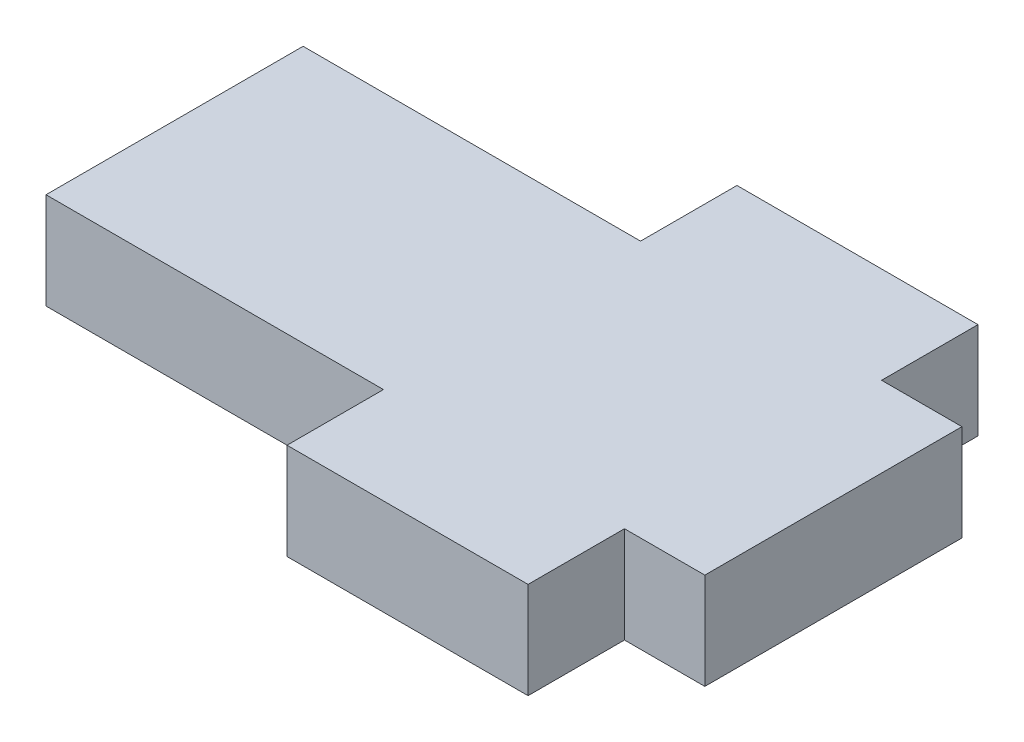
ISO-10303-21;
HEADER;
FILE_DESCRIPTION(('STEP AP214'),'2;1');
FILE_NAME('part.step','',(''),(''),'','','');
FILE_SCHEMA(('AUTOMOTIVE_DESIGN { 1 0 10303 214 1 1 1 1 }'));
ENDSEC;
DATA;
#1=APPLICATION_CONTEXT('core data for automotive mechanical design processes');
#2=APPLICATION_PROTOCOL_DEFINITION('international standard','automotive_design',2000,#1);
#3=PRODUCT_CONTEXT('',#1,'mechanical');
#4=PRODUCT('Part','Part','',(#3));
#5=PRODUCT_RELATED_PRODUCT_CATEGORY('part','',(#4));
#6=PRODUCT_DEFINITION_FORMATION('','',#4);
#7=PRODUCT_DEFINITION_CONTEXT('part definition',#1,'design');
#8=PRODUCT_DEFINITION('design','',#6,#7);
#9=PRODUCT_DEFINITION_SHAPE('','',#8);
#10=(LENGTH_UNIT() NAMED_UNIT(*) SI_UNIT(.MILLI.,.METRE.));
#11=(NAMED_UNIT(*) PLANE_ANGLE_UNIT() SI_UNIT($,.RADIAN.));
#12=(NAMED_UNIT(*) SI_UNIT($,.STERADIAN.) SOLID_ANGLE_UNIT());
#13=UNCERTAINTY_MEASURE_WITH_UNIT(LENGTH_MEASURE(1.E-05),#10,'distance_accuracy_value','');
#14=(GEOMETRIC_REPRESENTATION_CONTEXT(3) GLOBAL_UNCERTAINTY_ASSIGNED_CONTEXT((#13)) GLOBAL_UNIT_ASSIGNED_CONTEXT((#10,
#11,#12)) REPRESENTATION_CONTEXT('',''));
#15=CARTESIAN_POINT('',(0.,0.,0.));
#16=DIRECTION('',(0.,0.,1.));
#17=DIRECTION('',(1.,0.,0.));
#18=AXIS2_PLACEMENT_3D('',#15,#16,#17);
#19=CARTESIAN_POINT('',(7.5,6.,7.99999999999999));
#20=DIRECTION('',(0.,0.,-1.));
#21=DIRECTION('',(-1.,0.,0.));
#22=AXIS2_PLACEMENT_3D('',#19,#20,#21);
#23=PLANE('',#22);
#24=DIRECTION('',(1.,0.,0.));
#25=VECTOR('',#24,1.);
#26=CARTESIAN_POINT('',(7.5,0.,7.99999999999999));
#27=LINE('',#26,#25);
#28=CARTESIAN_POINT('',(7.5,0.,7.99999999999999));
#29=VERTEX_POINT('',#28);
#30=CARTESIAN_POINT('',(12.5,0.,8.));
#31=VERTEX_POINT('',#30);
#32=EDGE_CURVE('E170',#29,#31,#27,.T.);
#33=ORIENTED_EDGE('',*,*,#32,.T.);
#34=DIRECTION('',(0.,-1.,0.));
#35=VECTOR('',#34,1.);
#36=CARTESIAN_POINT('',(12.5,6.,8.));
#37=LINE('',#36,#35);
#38=CARTESIAN_POINT('',(12.5,6.,8.));
#39=VERTEX_POINT('',#38);
#40=EDGE_CURVE('E11',#39,#31,#37,.T.);
#41=ORIENTED_EDGE('',*,*,#40,.F.);
#42=DIRECTION('',(1.,0.,0.));
#43=VECTOR('',#42,1.);
#44=CARTESIAN_POINT('',(7.5,6.,7.99999999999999));
#45=LINE('',#44,#43);
#46=CARTESIAN_POINT('',(7.5,6.,7.99999999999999));
#47=VERTEX_POINT('',#46);
#48=EDGE_CURVE('E206',#47,#39,#45,.T.);
#49=ORIENTED_EDGE('',*,*,#48,.F.);
#50=DIRECTION('',(0.,-1.,0.));
#51=VECTOR('',#50,1.);
#52=CARTESIAN_POINT('',(7.5,6.,7.99999999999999));
#53=LINE('',#52,#51);
#54=EDGE_CURVE('E166',#47,#29,#53,.T.);
#55=ORIENTED_EDGE('',*,*,#54,.T.);
#56=EDGE_LOOP('',(#33,#41,#49,#55));
#57=FACE_BOUND('',#56,.T.);
#58=ADVANCED_FACE('F45',(#57),#23,.F.);
#59=CARTESIAN_POINT('',(12.5,6.,-8.));
#60=DIRECTION('',(-1.,0.,0.));
#61=DIRECTION('',(0.,0.,1.));
#62=AXIS2_PLACEMENT_3D('',#59,#60,#61);
#63=PLANE('',#62);
#64=DIRECTION('',(0.,0.,-1.));
#65=VECTOR('',#64,1.);
#66=CARTESIAN_POINT('',(12.5,0.,-8.));
#67=LINE('',#66,#65);
#68=CARTESIAN_POINT('',(12.5,0.,-8.));
#69=VERTEX_POINT('',#68);
#70=EDGE_CURVE('E174',#31,#69,#67,.T.);
#71=ORIENTED_EDGE('',*,*,#70,.T.);
#72=DIRECTION('',(0.,-1.,0.));
#73=VECTOR('',#72,1.);
#74=CARTESIAN_POINT('',(12.5,6.,-8.));
#75=LINE('',#74,#73);
#76=CARTESIAN_POINT('',(12.5,6.,-8.));
#77=VERTEX_POINT('',#76);
#78=EDGE_CURVE('E54',#77,#69,#75,.T.);
#79=ORIENTED_EDGE('',*,*,#78,.F.);
#80=DIRECTION('',(0.,0.,-1.));
#81=VECTOR('',#80,1.);
#82=CARTESIAN_POINT('',(12.5,6.,-8.));
#83=LINE('',#82,#81);
#84=EDGE_CURVE('E117',#39,#77,#83,.T.);
#85=ORIENTED_EDGE('',*,*,#84,.F.);
#86=ORIENTED_EDGE('',*,*,#40,.T.);
#87=EDGE_LOOP('',(#71,#79,#85,#86));
#88=FACE_BOUND('',#87,.T.);
#89=ADVANCED_FACE('F299',(#88),#63,.F.);
#90=CARTESIAN_POINT('',(7.5,6.,-8.));
#91=DIRECTION('',(0.,0.,1.));
#92=DIRECTION('',(1.,0.,0.));
#93=AXIS2_PLACEMENT_3D('',#90,#91,#92);
#94=PLANE('',#93);
#95=DIRECTION('',(-1.,0.,0.));
#96=VECTOR('',#95,1.);
#97=CARTESIAN_POINT('',(7.5,0.,-8.));
#98=LINE('',#97,#96);
#99=CARTESIAN_POINT('',(7.5,0.,-8.));
#100=VERTEX_POINT('',#99);
#101=EDGE_CURVE('E177',#69,#100,#98,.T.);
#102=ORIENTED_EDGE('',*,*,#101,.T.);
#103=DIRECTION('',(0.,-1.,0.));
#104=VECTOR('',#103,1.);
#105=CARTESIAN_POINT('',(7.5,6.,-8.));
#106=LINE('',#105,#104);
#107=CARTESIAN_POINT('',(7.5,6.,-8.));
#108=VERTEX_POINT('',#107);
#109=EDGE_CURVE('E233',#108,#100,#106,.T.);
#110=ORIENTED_EDGE('',*,*,#109,.F.);
#111=DIRECTION('',(-1.,0.,0.));
#112=VECTOR('',#111,1.);
#113=CARTESIAN_POINT('',(7.5,6.,-8.));
#114=LINE('',#113,#112);
#115=EDGE_CURVE('E243',#77,#108,#114,.T.);
#116=ORIENTED_EDGE('',*,*,#115,.F.);
#117=ORIENTED_EDGE('',*,*,#78,.T.);
#118=EDGE_LOOP('',(#102,#110,#116,#117));
#119=FACE_BOUND('',#118,.T.);
#120=ADVANCED_FACE('F241',(#119),#94,.F.);
#121=CARTESIAN_POINT('',(7.5,6.,-14.));
#122=DIRECTION('',(-1.,0.,0.));
#123=DIRECTION('',(0.,0.,1.));
#124=AXIS2_PLACEMENT_3D('',#121,#122,#123);
#125=PLANE('',#124);
#126=DIRECTION('',(0.,0.,-1.));
#127=VECTOR('',#126,1.);
#128=CARTESIAN_POINT('',(7.5,0.,-14.));
#129=LINE('',#128,#127);
#130=CARTESIAN_POINT('',(7.5,0.,-14.));
#131=VERTEX_POINT('',#130);
#132=EDGE_CURVE('E180',#100,#131,#129,.T.);
#133=ORIENTED_EDGE('',*,*,#132,.T.);
#134=DIRECTION('',(0.,-1.,0.));
#135=VECTOR('',#134,1.);
#136=CARTESIAN_POINT('',(7.5,6.,-14.));
#137=LINE('',#136,#135);
#138=CARTESIAN_POINT('',(7.5,6.,-14.));
#139=VERTEX_POINT('',#138);
#140=EDGE_CURVE('E229',#139,#131,#137,.T.);
#141=ORIENTED_EDGE('',*,*,#140,.F.);
#142=DIRECTION('',(0.,0.,-1.));
#143=VECTOR('',#142,1.);
#144=CARTESIAN_POINT('',(7.5,6.,-14.));
#145=LINE('',#144,#143);
#146=EDGE_CURVE('E262',#108,#139,#145,.T.);
#147=ORIENTED_EDGE('',*,*,#146,.F.);
#148=ORIENTED_EDGE('',*,*,#109,.T.);
#149=EDGE_LOOP('',(#133,#141,#147,#148));
#150=FACE_BOUND('',#149,.T.);
#151=ADVANCED_FACE('F252',(#150),#125,.F.);
#152=CARTESIAN_POINT('',(-7.5,6.,-14.));
#153=DIRECTION('',(0.,0.,1.));
#154=DIRECTION('',(1.,0.,0.));
#155=AXIS2_PLACEMENT_3D('',#152,#153,#154);
#156=PLANE('',#155);
#157=DIRECTION('',(-1.,0.,0.));
#158=VECTOR('',#157,1.);
#159=CARTESIAN_POINT('',(-7.5,0.,-14.));
#160=LINE('',#159,#158);
#161=CARTESIAN_POINT('',(-7.5,0.,-14.));
#162=VERTEX_POINT('',#161);
#163=EDGE_CURVE('E183',#131,#162,#160,.T.);
#164=ORIENTED_EDGE('',*,*,#163,.T.);
#165=DIRECTION('',(0.,-1.,0.));
#166=VECTOR('',#165,1.);
#167=CARTESIAN_POINT('',(-7.5,6.,-14.));
#168=LINE('',#167,#166);
#169=CARTESIAN_POINT('',(-7.5,6.,-14.));
#170=VERTEX_POINT('',#169);
#171=EDGE_CURVE('E225',#170,#162,#168,.T.);
#172=ORIENTED_EDGE('',*,*,#171,.F.);
#173=DIRECTION('',(-1.,0.,0.));
#174=VECTOR('',#173,1.);
#175=CARTESIAN_POINT('',(-7.5,6.,-14.));
#176=LINE('',#175,#174);
#177=EDGE_CURVE('E258',#139,#170,#176,.T.);
#178=ORIENTED_EDGE('',*,*,#177,.F.);
#179=ORIENTED_EDGE('',*,*,#140,.T.);
#180=EDGE_LOOP('',(#164,#172,#178,#179));
#181=FACE_BOUND('',#180,.T.);
#182=ADVANCED_FACE('F256',(#181),#156,.F.);
#183=CARTESIAN_POINT('',(-7.5,6.,-8.));
#184=DIRECTION('',(1.,0.,0.));
#185=DIRECTION('',(0.,0.,-1.));
#186=AXIS2_PLACEMENT_3D('',#183,#184,#185);
#187=PLANE('',#186);
#188=DIRECTION('',(0.,0.,1.));
#189=VECTOR('',#188,1.);
#190=CARTESIAN_POINT('',(-7.5,0.,-8.));
#191=LINE('',#190,#189);
#192=CARTESIAN_POINT('',(-7.5,0.,-8.));
#193=VERTEX_POINT('',#192);
#194=EDGE_CURVE('E186',#162,#193,#191,.T.);
#195=ORIENTED_EDGE('',*,*,#194,.T.);
#196=DIRECTION('',(0.,-1.,0.));
#197=VECTOR('',#196,1.);
#198=CARTESIAN_POINT('',(-7.5,6.,-8.));
#199=LINE('',#198,#197);
#200=CARTESIAN_POINT('',(-7.5,6.,-8.));
#201=VERTEX_POINT('',#200);
#202=EDGE_CURVE('E221',#201,#193,#199,.T.);
#203=ORIENTED_EDGE('',*,*,#202,.F.);
#204=DIRECTION('',(0.,0.,1.));
#205=VECTOR('',#204,1.);
#206=CARTESIAN_POINT('',(-7.5,6.,-8.));
#207=LINE('',#206,#205);
#208=EDGE_CURVE('E261',#170,#201,#207,.T.);
#209=ORIENTED_EDGE('',*,*,#208,.F.);
#210=ORIENTED_EDGE('',*,*,#171,.T.);
#211=EDGE_LOOP('',(#195,#203,#209,#210));
#212=FACE_BOUND('',#211,.T.);
#213=ADVANCED_FACE('F312',(#212),#187,.F.);
#214=CARTESIAN_POINT('',(-12.5,6.,-8.));
#215=DIRECTION('',(0.,0.,1.));
#216=DIRECTION('',(1.,0.,0.));
#217=AXIS2_PLACEMENT_3D('',#214,#215,#216);
#218=PLANE('',#217);
#219=DIRECTION('',(-1.,0.,0.));
#220=VECTOR('',#219,1.);
#221=CARTESIAN_POINT('',(-12.5,0.,-8.));
#222=LINE('',#221,#220);
#223=CARTESIAN_POINT('',(-28.5,0.,-8.));
#224=VERTEX_POINT('',#223);
#225=EDGE_CURVE('E190',#193,#224,#222,.T.);
#226=ORIENTED_EDGE('',*,*,#225,.T.);
#227=DIRECTION('',(0.,-1.,0.));
#228=VECTOR('',#227,1.);
#229=CARTESIAN_POINT('',(-28.5,6.,-8.));
#230=LINE('',#229,#228);
#231=CARTESIAN_POINT('',(-28.5,6.,-8.));
#232=VERTEX_POINT('',#231);
#233=EDGE_CURVE('E217',#232,#224,#230,.T.);
#234=ORIENTED_EDGE('',*,*,#233,.F.);
#235=DIRECTION('',(-1.,0.,0.));
#236=VECTOR('',#235,1.);
#237=CARTESIAN_POINT('',(-12.5,6.,-8.));
#238=LINE('',#237,#236);
#239=EDGE_CURVE('E266',#201,#232,#238,.T.);
#240=ORIENTED_EDGE('',*,*,#239,.F.);
#241=ORIENTED_EDGE('',*,*,#202,.T.);
#242=EDGE_LOOP('',(#226,#234,#240,#241));
#243=FACE_BOUND('',#242,.T.);
#244=ADVANCED_FACE('F315',(#243),#218,.F.);
#245=CARTESIAN_POINT('',(-28.5,6.,-8.));
#246=DIRECTION('',(1.,0.,0.));
#247=DIRECTION('',(0.,0.,-1.));
#248=AXIS2_PLACEMENT_3D('',#245,#246,#247);
#249=PLANE('',#248);
#250=DIRECTION('',(0.,0.,1.));
#251=VECTOR('',#250,1.);
#252=CARTESIAN_POINT('',(-28.5,0.,-8.));
#253=LINE('',#252,#251);
#254=CARTESIAN_POINT('',(-28.5,0.,8.));
#255=VERTEX_POINT('',#254);
#256=EDGE_CURVE('E193',#224,#255,#253,.T.);
#257=ORIENTED_EDGE('',*,*,#256,.T.);
#258=DIRECTION('',(0.,-1.,0.));
#259=VECTOR('',#258,1.);
#260=CARTESIAN_POINT('',(-28.5,6.,8.));
#261=LINE('',#260,#259);
#262=CARTESIAN_POINT('',(-28.5,6.,8.));
#263=VERTEX_POINT('',#262);
#264=EDGE_CURVE('E213',#263,#255,#261,.T.);
#265=ORIENTED_EDGE('',*,*,#264,.F.);
#266=DIRECTION('',(0.,0.,1.));
#267=VECTOR('',#266,1.);
#268=CARTESIAN_POINT('',(-28.5,6.,-8.));
#269=LINE('',#268,#267);
#270=EDGE_CURVE('E273',#232,#263,#269,.T.);
#271=ORIENTED_EDGE('',*,*,#270,.F.);
#272=ORIENTED_EDGE('',*,*,#233,.T.);
#273=EDGE_LOOP('',(#257,#265,#271,#272));
#274=FACE_BOUND('',#273,.T.);
#275=ADVANCED_FACE('F281',(#274),#249,.F.);
#276=CARTESIAN_POINT('',(-12.5,6.,8.));
#277=DIRECTION('',(0.,0.,-1.));
#278=DIRECTION('',(-1.,0.,0.));
#279=AXIS2_PLACEMENT_3D('',#276,#277,#278);
#280=PLANE('',#279);
#281=DIRECTION('',(1.,0.,0.));
#282=VECTOR('',#281,1.);
#283=CARTESIAN_POINT('',(-12.5,0.,8.));
#284=LINE('',#283,#282);
#285=CARTESIAN_POINT('',(-7.5,0.,7.99999999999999));
#286=VERTEX_POINT('',#285);
#287=EDGE_CURVE('E197',#255,#286,#284,.T.);
#288=ORIENTED_EDGE('',*,*,#287,.T.);
#289=DIRECTION('',(0.,-1.,0.));
#290=VECTOR('',#289,1.);
#291=CARTESIAN_POINT('',(-7.5,6.,7.99999999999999));
#292=LINE('',#291,#290);
#293=CARTESIAN_POINT('',(-7.5,6.,7.99999999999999));
#294=VERTEX_POINT('',#293);
#295=EDGE_CURVE('E159',#294,#286,#292,.T.);
#296=ORIENTED_EDGE('',*,*,#295,.F.);
#297=DIRECTION('',(1.,0.,0.));
#298=VECTOR('',#297,1.);
#299=CARTESIAN_POINT('',(-28.5,6.,8.));
#300=LINE('',#299,#298);
#301=EDGE_CURVE('E148',#263,#294,#300,.T.);
#302=ORIENTED_EDGE('',*,*,#301,.F.);
#303=ORIENTED_EDGE('',*,*,#264,.T.);
#304=EDGE_LOOP('',(#288,#296,#302,#303));
#305=FACE_BOUND('',#304,.T.);
#306=ADVANCED_FACE('F284',(#305),#280,.F.);
#307=CARTESIAN_POINT('',(-7.5,6.,7.99999999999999));
#308=DIRECTION('',(1.,0.,0.));
#309=DIRECTION('',(0.,0.,-1.));
#310=AXIS2_PLACEMENT_3D('',#307,#308,#309);
#311=PLANE('',#310);
#312=DIRECTION('',(0.,0.,1.));
#313=VECTOR('',#312,1.);
#314=CARTESIAN_POINT('',(-7.5,0.,7.99999999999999));
#315=LINE('',#314,#313);
#316=CARTESIAN_POINT('',(-7.5,0.,14.));
#317=VERTEX_POINT('',#316);
#318=EDGE_CURVE('E157',#286,#317,#315,.T.);
#319=ORIENTED_EDGE('',*,*,#318,.T.);
#320=DIRECTION('',(0.,-1.,0.));
#321=VECTOR('',#320,1.);
#322=CARTESIAN_POINT('',(-7.5,6.,14.));
#323=LINE('',#322,#321);
#324=CARTESIAN_POINT('',(-7.5,6.,14.));
#325=VERTEX_POINT('',#324);
#326=EDGE_CURVE('E154',#325,#317,#323,.T.);
#327=ORIENTED_EDGE('',*,*,#326,.F.);
#328=DIRECTION('',(0.,0.,1.));
#329=VECTOR('',#328,1.);
#330=CARTESIAN_POINT('',(-7.5,6.,7.99999999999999));
#331=LINE('',#330,#329);
#332=EDGE_CURVE('E142',#294,#325,#331,.T.);
#333=ORIENTED_EDGE('',*,*,#332,.F.);
#334=ORIENTED_EDGE('',*,*,#295,.T.);
#335=EDGE_LOOP('',(#319,#327,#333,#334));
#336=FACE_BOUND('',#335,.T.);
#337=ADVANCED_FACE('F155',(#336),#311,.F.);
#338=CARTESIAN_POINT('',(-7.5,6.,14.));
#339=DIRECTION('',(0.,0.,-1.));
#340=DIRECTION('',(-1.,0.,0.));
#341=AXIS2_PLACEMENT_3D('',#338,#339,#340);
#342=PLANE('',#341);
#343=DIRECTION('',(1.,0.,0.));
#344=VECTOR('',#343,1.);
#345=CARTESIAN_POINT('',(-7.5,0.,14.));
#346=LINE('',#345,#344);
#347=CARTESIAN_POINT('',(7.5,0.,14.));
#348=VERTEX_POINT('',#347);
#349=EDGE_CURVE('E103',#317,#348,#346,.T.);
#350=ORIENTED_EDGE('',*,*,#349,.T.);
#351=DIRECTION('',(0.,-1.,0.));
#352=VECTOR('',#351,1.);
#353=CARTESIAN_POINT('',(7.5,6.,14.));
#354=LINE('',#353,#352);
#355=CARTESIAN_POINT('',(7.5,6.,14.));
#356=VERTEX_POINT('',#355);
#357=EDGE_CURVE('E160',#356,#348,#354,.T.);
#358=ORIENTED_EDGE('',*,*,#357,.F.);
#359=DIRECTION('',(1.,0.,0.));
#360=VECTOR('',#359,1.);
#361=CARTESIAN_POINT('',(-7.5,6.,14.));
#362=LINE('',#361,#360);
#363=EDGE_CURVE('E146',#325,#356,#362,.T.);
#364=ORIENTED_EDGE('',*,*,#363,.F.);
#365=ORIENTED_EDGE('',*,*,#326,.T.);
#366=EDGE_LOOP('',(#350,#358,#364,#365));
#367=FACE_BOUND('',#366,.T.);
#368=ADVANCED_FACE('F162',(#367),#342,.F.);
#369=CARTESIAN_POINT('',(7.5,6.,14.));
#370=DIRECTION('',(-1.,0.,0.));
#371=DIRECTION('',(0.,0.,1.));
#372=AXIS2_PLACEMENT_3D('',#369,#370,#371);
#373=PLANE('',#372);
#374=DIRECTION('',(0.,0.,-1.));
#375=VECTOR('',#374,1.);
#376=CARTESIAN_POINT('',(7.5,0.,14.));
#377=LINE('',#376,#375);
#378=EDGE_CURVE('E109',#348,#29,#377,.T.);
#379=ORIENTED_EDGE('',*,*,#378,.T.);
#380=ORIENTED_EDGE('',*,*,#54,.F.);
#381=DIRECTION('',(0.,0.,-1.));
#382=VECTOR('',#381,1.);
#383=CARTESIAN_POINT('',(7.5,6.,14.));
#384=LINE('',#383,#382);
#385=EDGE_CURVE('E62',#356,#47,#384,.T.);
#386=ORIENTED_EDGE('',*,*,#385,.F.);
#387=ORIENTED_EDGE('',*,*,#357,.T.);
#388=EDGE_LOOP('',(#379,#380,#386,#387));
#389=FACE_BOUND('',#388,.T.);
#390=ADVANCED_FACE('F288',(#389),#373,.F.);
#391=CARTESIAN_POINT('',(0.,6.,0.));
#392=DIRECTION('',(0.,-1.,0.));
#393=DIRECTION('',(0.,0.,-1.));
#394=AXIS2_PLACEMENT_3D('',#391,#392,#393);
#395=PLANE('',#394);
#396=ORIENTED_EDGE('',*,*,#48,.T.);
#397=ORIENTED_EDGE('',*,*,#84,.T.);
#398=ORIENTED_EDGE('',*,*,#115,.T.);
#399=ORIENTED_EDGE('',*,*,#146,.T.);
#400=ORIENTED_EDGE('',*,*,#177,.T.);
#401=ORIENTED_EDGE('',*,*,#208,.T.);
#402=ORIENTED_EDGE('',*,*,#239,.T.);
#403=ORIENTED_EDGE('',*,*,#270,.T.);
#404=ORIENTED_EDGE('',*,*,#301,.T.);
#405=ORIENTED_EDGE('',*,*,#332,.T.);
#406=ORIENTED_EDGE('',*,*,#363,.T.);
#407=ORIENTED_EDGE('',*,*,#385,.T.);
#408=EDGE_LOOP('',(#396,#397,#398,#399,#400,#401,#402,#403,#404,#405,#406,#407));
#409=FACE_BOUND('',#408,.T.);
#410=ADVANCED_FACE('F144',(#409),#395,.F.);
#411=CARTESIAN_POINT('',(0.,0.,0.));
#412=DIRECTION('',(0.,-1.,0.));
#413=DIRECTION('',(0.,0.,-1.));
#414=AXIS2_PLACEMENT_3D('',#411,#412,#413);
#415=PLANE('',#414);
#416=ORIENTED_EDGE('',*,*,#32,.F.);
#417=ORIENTED_EDGE('',*,*,#378,.F.);
#418=ORIENTED_EDGE('',*,*,#349,.F.);
#419=ORIENTED_EDGE('',*,*,#318,.F.);
#420=ORIENTED_EDGE('',*,*,#287,.F.);
#421=ORIENTED_EDGE('',*,*,#256,.F.);
#422=ORIENTED_EDGE('',*,*,#225,.F.);
#423=ORIENTED_EDGE('',*,*,#194,.F.);
#424=ORIENTED_EDGE('',*,*,#163,.F.);
#425=ORIENTED_EDGE('',*,*,#132,.F.);
#426=ORIENTED_EDGE('',*,*,#101,.F.);
#427=ORIENTED_EDGE('',*,*,#70,.F.);
#428=EDGE_LOOP('',(#416,#417,#418,#419,#420,#421,#422,#423,#424,#425,#426,#427));
#429=FACE_BOUND('',#428,.T.);
#430=ADVANCED_FACE('F247',(#429),#415,.T.);
#431=CLOSED_SHELL('',(#58,#89,#120,#151,#182,#213,#244,#275,#306,#337,#368,#390,#410,#430));
#432=MANIFOLD_SOLID_BREP('B2',#431);
#433=ADVANCED_BREP_SHAPE_REPRESENTATION('',(#18,#432),#14);
#434=SHAPE_DEFINITION_REPRESENTATION(#9,#433);
ENDSEC;
END-ISO-10303-21;
